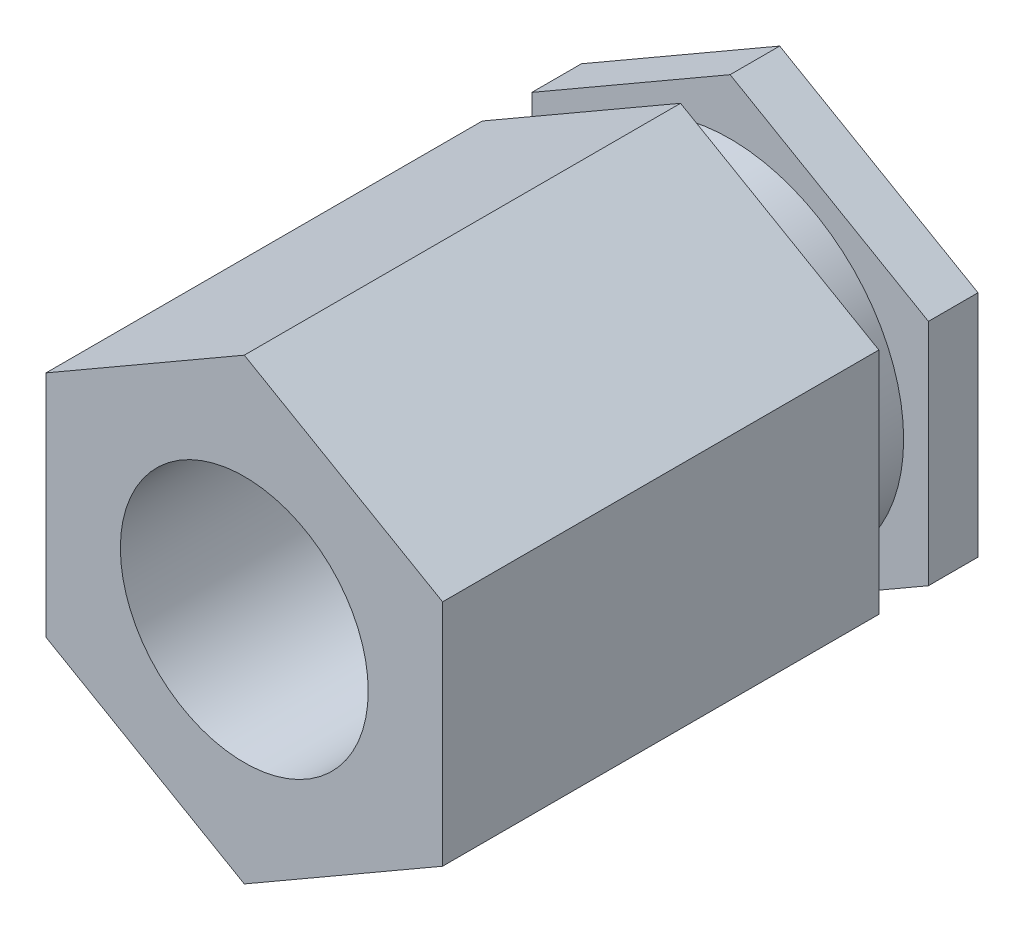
ISO-10303-21;
HEADER;
FILE_DESCRIPTION(('STEP AP214'),'2;1');
FILE_NAME('part.step','',(''),(''),'','','');
FILE_SCHEMA(('AUTOMOTIVE_DESIGN { 1 0 10303 214 1 1 1 1 }'));
ENDSEC;
DATA;
#1=APPLICATION_CONTEXT('core data for automotive mechanical design processes');
#2=APPLICATION_PROTOCOL_DEFINITION('international standard','automotive_design',2000,#1);
#3=PRODUCT_CONTEXT('',#1,'mechanical');
#4=PRODUCT('Part','Part','',(#3));
#5=PRODUCT_RELATED_PRODUCT_CATEGORY('part','',(#4));
#6=PRODUCT_DEFINITION_FORMATION('','',#4);
#7=PRODUCT_DEFINITION_CONTEXT('part definition',#1,'design');
#8=PRODUCT_DEFINITION('design','',#6,#7);
#9=PRODUCT_DEFINITION_SHAPE('','',#8);
#10=(LENGTH_UNIT() NAMED_UNIT(*) SI_UNIT(.MILLI.,.METRE.));
#11=(NAMED_UNIT(*) PLANE_ANGLE_UNIT() SI_UNIT($,.RADIAN.));
#12=(NAMED_UNIT(*) SI_UNIT($,.STERADIAN.) SOLID_ANGLE_UNIT());
#13=UNCERTAINTY_MEASURE_WITH_UNIT(LENGTH_MEASURE(1.E-05),#10,'distance_accuracy_value','');
#14=(GEOMETRIC_REPRESENTATION_CONTEXT(3) GLOBAL_UNCERTAINTY_ASSIGNED_CONTEXT((#13)) GLOBAL_UNIT_ASSIGNED_CONTEXT((#10,
#11,#12)) REPRESENTATION_CONTEXT('',''));
#15=CARTESIAN_POINT('',(0.,0.,0.));
#16=DIRECTION('',(0.,0.,1.));
#17=DIRECTION('',(1.,0.,0.));
#18=AXIS2_PLACEMENT_3D('',#15,#16,#17);
#19=CARTESIAN_POINT('',(4.,2.30940107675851,-10.8));
#20=DIRECTION('',(0.5,0.866025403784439,0.));
#21=DIRECTION('',(-0.866025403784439,0.5,0.));
#22=AXIS2_PLACEMENT_3D('',#19,#20,#21);
#23=PLANE('',#22);
#24=DIRECTION('',(0.,0.,1.));
#25=VECTOR('',#24,1.);
#26=CARTESIAN_POINT('',(4.,2.30940107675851,-10.8));
#27=LINE('',#26,#25);
#28=CARTESIAN_POINT('',(4.,2.30940107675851,-8.8));
#29=VERTEX_POINT('',#28);
#30=CARTESIAN_POINT('',(4.,2.30940107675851,0.));
#31=VERTEX_POINT('',#30);
#32=EDGE_CURVE('E485',#29,#31,#27,.T.);
#33=ORIENTED_EDGE('',*,*,#32,.F.);
#34=DIRECTION('',(-0.866025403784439,0.5,0.));
#35=VECTOR('',#34,1.);
#36=CARTESIAN_POINT('',(4.,2.30940107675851,-8.8));
#37=LINE('',#36,#35);
#38=CARTESIAN_POINT('',(0.,4.61880215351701,-8.8));
#39=VERTEX_POINT('',#38);
#40=EDGE_CURVE('E555',#29,#39,#37,.T.);
#41=ORIENTED_EDGE('',*,*,#40,.T.);
#42=DIRECTION('',(0.,0.,1.));
#43=VECTOR('',#42,1.);
#44=CARTESIAN_POINT('',(0.,4.61880215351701,-10.8));
#45=LINE('',#44,#43);
#46=CARTESIAN_POINT('',(0.,4.61880215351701,0.));
#47=VERTEX_POINT('',#46);
#48=EDGE_CURVE('E464',#39,#47,#45,.T.);
#49=ORIENTED_EDGE('',*,*,#48,.T.);
#50=DIRECTION('',(-0.866025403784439,0.5,0.));
#51=VECTOR('',#50,1.);
#52=CARTESIAN_POINT('',(4.,2.30940107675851,0.));
#53=LINE('',#52,#51);
#54=EDGE_CURVE('E563',#31,#47,#53,.T.);
#55=ORIENTED_EDGE('',*,*,#54,.F.);
#56=EDGE_LOOP('',(#33,#41,#49,#55));
#57=FACE_BOUND('',#56,.T.);
#58=ADVANCED_FACE('F350',(#57),#23,.T.);
#59=CARTESIAN_POINT('',(0.,4.61880215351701,-10.8));
#60=VERTEX_POINT('',#59);
#61=CARTESIAN_POINT('',(0.,4.61880215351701,-9.8));
#62=VERTEX_POINT('',#61);
#63=EDGE_CURVE('E461',#60,#62,#45,.T.);
#64=ORIENTED_EDGE('',*,*,#63,.T.);
#65=DIRECTION('',(0.866025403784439,-0.5,0.));
#66=VECTOR('',#65,1.);
#67=CARTESIAN_POINT('',(4.,2.30940107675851,-9.8));
#68=LINE('',#67,#66);
#69=CARTESIAN_POINT('',(4.,2.30940107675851,-9.8));
#70=VERTEX_POINT('',#69);
#71=EDGE_CURVE('E371',#62,#70,#68,.T.);
#72=ORIENTED_EDGE('',*,*,#71,.T.);
#73=CARTESIAN_POINT('',(4.,2.30940107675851,-10.8));
#74=VERTEX_POINT('',#73);
#75=EDGE_CURVE('E442',#74,#70,#27,.T.);
#76=ORIENTED_EDGE('',*,*,#75,.F.);
#77=DIRECTION('',(-0.866025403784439,0.5,0.));
#78=VECTOR('',#77,1.);
#79=CARTESIAN_POINT('',(4.,2.30940107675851,-10.8));
#80=LINE('',#79,#78);
#81=EDGE_CURVE('E527',#74,#60,#80,.T.);
#82=ORIENTED_EDGE('',*,*,#81,.T.);
#83=EDGE_LOOP('',(#64,#72,#76,#82));
#84=FACE_BOUND('',#83,.T.);
#85=ADVANCED_FACE('F577',(#84),#23,.T.);
#86=CARTESIAN_POINT('',(4.,-2.3094010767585,-10.8));
#87=DIRECTION('',(1.,0.,0.));
#88=DIRECTION('',(0.,0.,-1.));
#89=AXIS2_PLACEMENT_3D('',#86,#87,#88);
#90=PLANE('',#89);
#91=DIRECTION('',(0.,0.,1.));
#92=VECTOR('',#91,1.);
#93=CARTESIAN_POINT('',(4.,-2.3094010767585,-10.8));
#94=LINE('',#93,#92);
#95=CARTESIAN_POINT('',(4.,-2.3094010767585,-8.8));
#96=VERTEX_POINT('',#95);
#97=CARTESIAN_POINT('',(4.,-2.3094010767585,0.));
#98=VERTEX_POINT('',#97);
#99=EDGE_CURVE('E488',#96,#98,#94,.T.);
#100=ORIENTED_EDGE('',*,*,#99,.F.);
#101=DIRECTION('',(0.,1.,0.));
#102=VECTOR('',#101,1.);
#103=CARTESIAN_POINT('',(4.,-2.3094010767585,-8.8));
#104=LINE('',#103,#102);
#105=EDGE_CURVE('E552',#96,#29,#104,.T.);
#106=ORIENTED_EDGE('',*,*,#105,.T.);
#107=ORIENTED_EDGE('',*,*,#32,.T.);
#108=DIRECTION('',(0.,1.,0.));
#109=VECTOR('',#108,1.);
#110=CARTESIAN_POINT('',(4.,-2.3094010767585,0.));
#111=LINE('',#110,#109);
#112=EDGE_CURVE('E514',#98,#31,#111,.T.);
#113=ORIENTED_EDGE('',*,*,#112,.F.);
#114=EDGE_LOOP('',(#100,#106,#107,#113));
#115=FACE_BOUND('',#114,.T.);
#116=ADVANCED_FACE('F581',(#115),#90,.T.);
#117=ORIENTED_EDGE('',*,*,#75,.T.);
#118=DIRECTION('',(0.,-1.,0.));
#119=VECTOR('',#118,1.);
#120=CARTESIAN_POINT('',(4.,-2.3094010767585,-9.8));
#121=LINE('',#120,#119);
#122=CARTESIAN_POINT('',(4.,-2.3094010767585,-9.8));
#123=VERTEX_POINT('',#122);
#124=EDGE_CURVE('E542',#70,#123,#121,.T.);
#125=ORIENTED_EDGE('',*,*,#124,.T.);
#126=CARTESIAN_POINT('',(4.,-2.3094010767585,-10.8));
#127=VERTEX_POINT('',#126);
#128=EDGE_CURVE('E486',#127,#123,#94,.T.);
#129=ORIENTED_EDGE('',*,*,#128,.F.);
#130=DIRECTION('',(0.,1.,0.));
#131=VECTOR('',#130,1.);
#132=CARTESIAN_POINT('',(4.,-2.3094010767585,-10.8));
#133=LINE('',#132,#131);
#134=EDGE_CURVE('E467',#127,#74,#133,.T.);
#135=ORIENTED_EDGE('',*,*,#134,.T.);
#136=EDGE_LOOP('',(#117,#125,#129,#135));
#137=FACE_BOUND('',#136,.T.);
#138=ADVANCED_FACE('F617',(#137),#90,.T.);
#139=CARTESIAN_POINT('',(0.,-4.61880215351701,-10.8));
#140=DIRECTION('',(0.5,-0.866025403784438,0.));
#141=DIRECTION('',(0.866025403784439,0.5,0.));
#142=AXIS2_PLACEMENT_3D('',#139,#140,#141);
#143=PLANE('',#142);
#144=DIRECTION('',(0.,0.,1.));
#145=VECTOR('',#144,1.);
#146=CARTESIAN_POINT('',(0.,-4.61880215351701,-10.8));
#147=LINE('',#146,#145);
#148=CARTESIAN_POINT('',(0.,-4.61880215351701,-8.8));
#149=VERTEX_POINT('',#148);
#150=CARTESIAN_POINT('',(0.,-4.61880215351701,0.));
#151=VERTEX_POINT('',#150);
#152=EDGE_CURVE('E491',#149,#151,#147,.T.);
#153=ORIENTED_EDGE('',*,*,#152,.F.);
#154=DIRECTION('',(0.866025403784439,0.5,0.));
#155=VECTOR('',#154,1.);
#156=CARTESIAN_POINT('',(0.,-4.61880215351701,-8.8));
#157=LINE('',#156,#155);
#158=EDGE_CURVE('E550',#149,#96,#157,.T.);
#159=ORIENTED_EDGE('',*,*,#158,.T.);
#160=ORIENTED_EDGE('',*,*,#99,.T.);
#161=DIRECTION('',(0.866025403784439,0.5,0.));
#162=VECTOR('',#161,1.);
#163=CARTESIAN_POINT('',(0.,-4.61880215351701,0.));
#164=LINE('',#163,#162);
#165=EDGE_CURVE('E508',#151,#98,#164,.T.);
#166=ORIENTED_EDGE('',*,*,#165,.F.);
#167=EDGE_LOOP('',(#153,#159,#160,#166));
#168=FACE_BOUND('',#167,.T.);
#169=ADVANCED_FACE('F509',(#168),#143,.T.);
#170=ORIENTED_EDGE('',*,*,#128,.T.);
#171=DIRECTION('',(-0.866025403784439,-0.5,0.));
#172=VECTOR('',#171,1.);
#173=CARTESIAN_POINT('',(0.,-4.61880215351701,-9.8));
#174=LINE('',#173,#172);
#175=CARTESIAN_POINT('',(0.,-4.61880215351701,-9.8));
#176=VERTEX_POINT('',#175);
#177=EDGE_CURVE('E540',#123,#176,#174,.T.);
#178=ORIENTED_EDGE('',*,*,#177,.T.);
#179=CARTESIAN_POINT('',(0.,-4.61880215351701,-10.8));
#180=VERTEX_POINT('',#179);
#181=EDGE_CURVE('E489',#180,#176,#147,.T.);
#182=ORIENTED_EDGE('',*,*,#181,.F.);
#183=DIRECTION('',(0.866025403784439,0.5,0.));
#184=VECTOR('',#183,1.);
#185=CARTESIAN_POINT('',(0.,-4.61880215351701,-10.8));
#186=LINE('',#185,#184);
#187=EDGE_CURVE('E474',#180,#127,#186,.T.);
#188=ORIENTED_EDGE('',*,*,#187,.T.);
#189=EDGE_LOOP('',(#170,#178,#182,#188));
#190=FACE_BOUND('',#189,.T.);
#191=ADVANCED_FACE('F538',(#190),#143,.T.);
#192=CARTESIAN_POINT('',(-4.,-2.30940107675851,-10.8));
#193=DIRECTION('',(-0.5,-0.866025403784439,0.));
#194=DIRECTION('',(0.866025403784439,-0.5,0.));
#195=AXIS2_PLACEMENT_3D('',#192,#193,#194);
#196=PLANE('',#195);
#197=DIRECTION('',(0.,0.,1.));
#198=VECTOR('',#197,1.);
#199=CARTESIAN_POINT('',(-4.,-2.30940107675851,-10.8));
#200=LINE('',#199,#198);
#201=CARTESIAN_POINT('',(-4.,-2.30940107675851,-8.8));
#202=VERTEX_POINT('',#201);
#203=CARTESIAN_POINT('',(-4.,-2.30940107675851,0.));
#204=VERTEX_POINT('',#203);
#205=EDGE_CURVE('E457',#202,#204,#200,.T.);
#206=ORIENTED_EDGE('',*,*,#205,.F.);
#207=DIRECTION('',(0.866025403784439,-0.5,0.));
#208=VECTOR('',#207,1.);
#209=CARTESIAN_POINT('',(-4.,-2.30940107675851,-8.8));
#210=LINE('',#209,#208);
#211=EDGE_CURVE('E504',#202,#149,#210,.T.);
#212=ORIENTED_EDGE('',*,*,#211,.T.);
#213=ORIENTED_EDGE('',*,*,#152,.T.);
#214=DIRECTION('',(0.866025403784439,-0.5,0.));
#215=VECTOR('',#214,1.);
#216=CARTESIAN_POINT('',(-4.,-2.30940107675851,0.));
#217=LINE('',#216,#215);
#218=EDGE_CURVE('E502',#204,#151,#217,.T.);
#219=ORIENTED_EDGE('',*,*,#218,.F.);
#220=EDGE_LOOP('',(#206,#212,#213,#219));
#221=FACE_BOUND('',#220,.T.);
#222=ADVANCED_FACE('F500',(#221),#196,.T.);
#223=ORIENTED_EDGE('',*,*,#181,.T.);
#224=DIRECTION('',(-0.866025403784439,0.5,0.));
#225=VECTOR('',#224,1.);
#226=CARTESIAN_POINT('',(-4.,-2.30940107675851,-9.8));
#227=LINE('',#226,#225);
#228=CARTESIAN_POINT('',(-4.,-2.30940107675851,-9.8));
#229=VERTEX_POINT('',#228);
#230=EDGE_CURVE('E450',#176,#229,#227,.T.);
#231=ORIENTED_EDGE('',*,*,#230,.T.);
#232=CARTESIAN_POINT('',(-4.,-2.30940107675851,-10.8));
#233=VERTEX_POINT('',#232);
#234=EDGE_CURVE('E449',#233,#229,#200,.T.);
#235=ORIENTED_EDGE('',*,*,#234,.F.);
#236=DIRECTION('',(0.866025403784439,-0.5,0.));
#237=VECTOR('',#236,1.);
#238=CARTESIAN_POINT('',(-4.,-2.30940107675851,-10.8));
#239=LINE('',#238,#237);
#240=EDGE_CURVE('E480',#233,#180,#239,.T.);
#241=ORIENTED_EDGE('',*,*,#240,.T.);
#242=EDGE_LOOP('',(#223,#231,#235,#241));
#243=FACE_BOUND('',#242,.T.);
#244=ADVANCED_FACE('F532',(#243),#196,.T.);
#245=CARTESIAN_POINT('',(-4.,2.3094010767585,-10.8));
#246=DIRECTION('',(-1.,0.,0.));
#247=DIRECTION('',(0.,-1.,0.));
#248=AXIS2_PLACEMENT_3D('',#245,#246,#247);
#249=PLANE('',#248);
#250=DIRECTION('',(0.,0.,1.));
#251=VECTOR('',#250,1.);
#252=CARTESIAN_POINT('',(-4.,2.3094010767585,-10.8));
#253=LINE('',#252,#251);
#254=CARTESIAN_POINT('',(-4.,2.3094010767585,-8.8));
#255=VERTEX_POINT('',#254);
#256=CARTESIAN_POINT('',(-4.,2.3094010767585,0.));
#257=VERTEX_POINT('',#256);
#258=EDGE_CURVE('E458',#255,#257,#253,.T.);
#259=ORIENTED_EDGE('',*,*,#258,.F.);
#260=DIRECTION('',(0.,-1.,0.));
#261=VECTOR('',#260,1.);
#262=CARTESIAN_POINT('',(-4.,2.3094010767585,-8.8));
#263=LINE('',#262,#261);
#264=EDGE_CURVE('E364',#255,#202,#263,.T.);
#265=ORIENTED_EDGE('',*,*,#264,.T.);
#266=ORIENTED_EDGE('',*,*,#205,.T.);
#267=DIRECTION('',(0.,-1.,0.));
#268=VECTOR('',#267,1.);
#269=CARTESIAN_POINT('',(-4.,2.3094010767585,0.));
#270=LINE('',#269,#268);
#271=EDGE_CURVE('E520',#257,#204,#270,.T.);
#272=ORIENTED_EDGE('',*,*,#271,.F.);
#273=EDGE_LOOP('',(#259,#265,#266,#272));
#274=FACE_BOUND('',#273,.T.);
#275=ADVANCED_FACE('F568',(#274),#249,.T.);
#276=ORIENTED_EDGE('',*,*,#234,.T.);
#277=DIRECTION('',(0.,1.,0.));
#278=VECTOR('',#277,1.);
#279=CARTESIAN_POINT('',(-4.,2.3094010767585,-9.8));
#280=LINE('',#279,#278);
#281=CARTESIAN_POINT('',(-4.,2.3094010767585,-9.8));
#282=VERTEX_POINT('',#281);
#283=EDGE_CURVE('E437',#229,#282,#280,.T.);
#284=ORIENTED_EDGE('',*,*,#283,.T.);
#285=CARTESIAN_POINT('',(-4.,2.3094010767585,-10.8));
#286=VERTEX_POINT('',#285);
#287=EDGE_CURVE('E447',#286,#282,#253,.T.);
#288=ORIENTED_EDGE('',*,*,#287,.F.);
#289=DIRECTION('',(0.,-1.,0.));
#290=VECTOR('',#289,1.);
#291=CARTESIAN_POINT('',(-4.,2.3094010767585,-10.8));
#292=LINE('',#291,#290);
#293=EDGE_CURVE('E530',#286,#233,#292,.T.);
#294=ORIENTED_EDGE('',*,*,#293,.T.);
#295=EDGE_LOOP('',(#276,#284,#288,#294));
#296=FACE_BOUND('',#295,.T.);
#297=ADVANCED_FACE('F445',(#296),#249,.T.);
#298=CARTESIAN_POINT('',(0.,4.61880215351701,-10.8));
#299=DIRECTION('',(-0.5,0.866025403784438,0.));
#300=DIRECTION('',(-0.866025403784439,-0.5,0.));
#301=AXIS2_PLACEMENT_3D('',#298,#299,#300);
#302=PLANE('',#301);
#303=ORIENTED_EDGE('',*,*,#48,.F.);
#304=DIRECTION('',(-0.866025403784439,-0.5,0.));
#305=VECTOR('',#304,1.);
#306=CARTESIAN_POINT('',(0.,4.61880215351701,-8.8));
#307=LINE('',#306,#305);
#308=EDGE_CURVE('E11',#39,#255,#307,.T.);
#309=ORIENTED_EDGE('',*,*,#308,.T.);
#310=ORIENTED_EDGE('',*,*,#258,.T.);
#311=DIRECTION('',(-0.866025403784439,-0.5,0.));
#312=VECTOR('',#311,1.);
#313=CARTESIAN_POINT('',(0.,4.61880215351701,0.));
#314=LINE('',#313,#312);
#315=EDGE_CURVE('E522',#47,#257,#314,.T.);
#316=ORIENTED_EDGE('',*,*,#315,.F.);
#317=EDGE_LOOP('',(#303,#309,#310,#316));
#318=FACE_BOUND('',#317,.T.);
#319=ADVANCED_FACE('F565',(#318),#302,.T.);
#320=ORIENTED_EDGE('',*,*,#287,.T.);
#321=DIRECTION('',(0.866025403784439,0.5,0.));
#322=VECTOR('',#321,1.);
#323=CARTESIAN_POINT('',(0.,4.61880215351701,-9.8));
#324=LINE('',#323,#322);
#325=EDGE_CURVE('E357',#282,#62,#324,.T.);
#326=ORIENTED_EDGE('',*,*,#325,.T.);
#327=ORIENTED_EDGE('',*,*,#63,.F.);
#328=DIRECTION('',(-0.866025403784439,-0.5,0.));
#329=VECTOR('',#328,1.);
#330=CARTESIAN_POINT('',(0.,4.61880215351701,-10.8));
#331=LINE('',#330,#329);
#332=EDGE_CURVE('E456',#60,#286,#331,.T.);
#333=ORIENTED_EDGE('',*,*,#332,.T.);
#334=EDGE_LOOP('',(#320,#326,#327,#333));
#335=FACE_BOUND('',#334,.T.);
#336=ADVANCED_FACE('F454',(#335),#302,.T.);
#337=CARTESIAN_POINT('',(4.,2.30940107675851,-10.8));
#338=DIRECTION('',(0.,0.,-1.));
#339=DIRECTION('',(-1.,0.,0.));
#340=AXIS2_PLACEMENT_3D('',#337,#338,#339);
#341=PLANE('',#340);
#342=CARTESIAN_POINT('',(0.,0.,-10.8));
#343=DIRECTION('',(0.,0.,1.));
#344=DIRECTION('',(1.,0.,0.));
#345=AXIS2_PLACEMENT_3D('',#342,#343,#344);
#346=CIRCLE('',#345,2.5);
#347=CARTESIAN_POINT('',(2.5,0.,-10.8));
#348=VERTEX_POINT('',#347);
#349=EDGE_CURVE('E560',#348,#348,#346,.T.);
#350=ORIENTED_EDGE('',*,*,#349,.T.);
#351=EDGE_LOOP('',(#350));
#352=FACE_BOUND('',#351,.T.);
#353=ORIENTED_EDGE('',*,*,#81,.F.);
#354=ORIENTED_EDGE('',*,*,#134,.F.);
#355=ORIENTED_EDGE('',*,*,#187,.F.);
#356=ORIENTED_EDGE('',*,*,#240,.F.);
#357=ORIENTED_EDGE('',*,*,#293,.F.);
#358=ORIENTED_EDGE('',*,*,#332,.F.);
#359=EDGE_LOOP('',(#353,#354,#355,#356,#357,#358));
#360=FACE_BOUND('',#359,.T.);
#361=ADVANCED_FACE('F536',(#352,#360),#341,.T.);
#362=CARTESIAN_POINT('',(4.,2.30940107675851,0.));
#363=DIRECTION('',(0.,0.,-1.));
#364=DIRECTION('',(-1.,0.,0.));
#365=AXIS2_PLACEMENT_3D('',#362,#363,#364);
#366=PLANE('',#365);
#367=CARTESIAN_POINT('',(0.,0.,0.));
#368=DIRECTION('',(0.,0.,1.));
#369=DIRECTION('',(1.,0.,0.));
#370=AXIS2_PLACEMENT_3D('',#367,#368,#369);
#371=CIRCLE('',#370,2.5);
#372=CARTESIAN_POINT('',(2.5,0.,0.));
#373=VERTEX_POINT('',#372);
#374=EDGE_CURVE('E557',#373,#373,#371,.T.);
#375=ORIENTED_EDGE('',*,*,#374,.F.);
#376=EDGE_LOOP('',(#375));
#377=FACE_BOUND('',#376,.T.);
#378=ORIENTED_EDGE('',*,*,#54,.T.);
#379=ORIENTED_EDGE('',*,*,#315,.T.);
#380=ORIENTED_EDGE('',*,*,#271,.T.);
#381=ORIENTED_EDGE('',*,*,#218,.T.);
#382=ORIENTED_EDGE('',*,*,#165,.T.);
#383=ORIENTED_EDGE('',*,*,#112,.T.);
#384=EDGE_LOOP('',(#378,#379,#380,#381,#382,#383));
#385=FACE_BOUND('',#384,.T.);
#386=ADVANCED_FACE('F517',(#377,#385),#366,.F.);
#387=CARTESIAN_POINT('',(0.,0.,-10.8));
#388=DIRECTION('',(0.,0.,1.));
#389=DIRECTION('',(1.,0.,0.));
#390=AXIS2_PLACEMENT_3D('',#387,#388,#389);
#391=CYLINDRICAL_SURFACE('',#390,2.5);
#392=CARTESIAN_POINT('',(2.5,0.,-10.8));
#393=CARTESIAN_POINT('',(2.5,0.,-10.6875));
#394=CARTESIAN_POINT('',(2.5,0.,-10.575));
#395=CARTESIAN_POINT('',(2.5,0.,-10.35));
#396=CARTESIAN_POINT('',(2.5,0.,-10.2375));
#397=CARTESIAN_POINT('',(2.5,0.,-10.0125));
#398=CARTESIAN_POINT('',(2.5,0.,-9.9));
#399=CARTESIAN_POINT('',(2.5,0.,-9.675));
#400=CARTESIAN_POINT('',(2.5,0.,-9.5625));
#401=CARTESIAN_POINT('',(2.5,0.,-9.3375));
#402=CARTESIAN_POINT('',(2.5,0.,-9.225));
#403=CARTESIAN_POINT('',(2.5,0.,-9.));
#404=CARTESIAN_POINT('',(2.5,0.,-8.8875));
#405=CARTESIAN_POINT('',(2.5,0.,-8.6625));
#406=CARTESIAN_POINT('',(2.5,0.,-8.55));
#407=CARTESIAN_POINT('',(2.5,0.,-8.325));
#408=CARTESIAN_POINT('',(2.5,0.,-8.2125));
#409=CARTESIAN_POINT('',(2.5,0.,-7.9875));
#410=CARTESIAN_POINT('',(2.5,0.,-7.875));
#411=CARTESIAN_POINT('',(2.5,0.,-7.65));
#412=CARTESIAN_POINT('',(2.5,0.,-7.5375));
#413=CARTESIAN_POINT('',(2.5,0.,-7.3125));
#414=CARTESIAN_POINT('',(2.5,0.,-7.2));
#415=CARTESIAN_POINT('',(2.5,0.,-6.975));
#416=CARTESIAN_POINT('',(2.5,0.,-6.8625));
#417=CARTESIAN_POINT('',(2.5,0.,-6.6375));
#418=CARTESIAN_POINT('',(2.5,0.,-6.525));
#419=CARTESIAN_POINT('',(2.5,0.,-6.3));
#420=CARTESIAN_POINT('',(2.5,0.,-6.1875));
#421=CARTESIAN_POINT('',(2.5,0.,-5.9625));
#422=CARTESIAN_POINT('',(2.5,0.,-5.85));
#423=CARTESIAN_POINT('',(2.5,0.,-5.625));
#424=CARTESIAN_POINT('',(2.5,0.,-5.5125));
#425=CARTESIAN_POINT('',(2.5,0.,-5.2875));
#426=CARTESIAN_POINT('',(2.5,0.,-5.175));
#427=CARTESIAN_POINT('',(2.5,0.,-4.95));
#428=CARTESIAN_POINT('',(2.5,0.,-4.8375));
#429=CARTESIAN_POINT('',(2.5,0.,-4.6125));
#430=CARTESIAN_POINT('',(2.5,0.,-4.5));
#431=CARTESIAN_POINT('',(2.5,0.,-4.275));
#432=CARTESIAN_POINT('',(2.5,0.,-4.1625));
#433=CARTESIAN_POINT('',(2.5,0.,-3.9375));
#434=CARTESIAN_POINT('',(2.5,0.,-3.825));
#435=CARTESIAN_POINT('',(2.5,0.,-3.6));
#436=CARTESIAN_POINT('',(2.5,0.,-3.4875));
#437=CARTESIAN_POINT('',(2.5,0.,-3.2625));
#438=CARTESIAN_POINT('',(2.5,0.,-3.15));
#439=CARTESIAN_POINT('',(2.5,0.,-2.925));
#440=CARTESIAN_POINT('',(2.5,0.,-2.8125));
#441=CARTESIAN_POINT('',(2.5,0.,-2.5875));
#442=CARTESIAN_POINT('',(2.5,0.,-2.475));
#443=CARTESIAN_POINT('',(2.5,0.,-2.25));
#444=CARTESIAN_POINT('',(2.5,0.,-2.1375));
#445=CARTESIAN_POINT('',(2.5,0.,-1.9125));
#446=CARTESIAN_POINT('',(2.5,0.,-1.8));
#447=CARTESIAN_POINT('',(2.5,0.,-1.575));
#448=CARTESIAN_POINT('',(2.5,0.,-1.4625));
#449=CARTESIAN_POINT('',(2.5,0.,-1.2375));
#450=CARTESIAN_POINT('',(2.5,0.,-1.125));
#451=CARTESIAN_POINT('',(2.5,0.,-0.900000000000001));
#452=CARTESIAN_POINT('',(2.5,0.,-0.787500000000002));
#453=CARTESIAN_POINT('',(2.5,0.,-0.562500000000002));
#454=CARTESIAN_POINT('',(2.5,0.,-0.450000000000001));
#455=CARTESIAN_POINT('',(2.5,0.,-0.225000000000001));
#456=CARTESIAN_POINT('',(2.5,0.,-0.112500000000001));
#457=CARTESIAN_POINT('',(2.5,0.,0.));
#458=B_SPLINE_CURVE_WITH_KNOTS('',3,(#392,#393,#394,#395,#396,#397,#398,#399,#400,#401,#402,
#403,#404,#405,#406,#407,#408,#409,#410,#411,#412,#413,#414,#415,#416,#417,#418,#419,#420,#421,
#422,#423,#424,#425,#426,#427,#428,#429,#430,#431,#432,#433,#434,#435,#436,#437,#438,#439,#440,
#441,#442,#443,#444,#445,#446,#447,#448,#449,#450,#451,#452,#453,#454,#455,#456,#457),
.UNSPECIFIED.,.F.,.F.,(4,2,2,2,2,2,2,2,2,2,2,2,2,2,2,2,2,2,2,2,2,2,2,2,2,2,2,2,2,2,2,2,4),(0.,
0.337500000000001,0.675,1.0125,1.35,1.6875,2.025,2.3625,2.7,3.0375,3.375,3.7125,4.05,4.3875,
4.725,5.0625,5.4,5.7375,6.075,6.4125,6.75,7.0875,7.425,7.7625,8.1,8.4375,8.775,9.1125,9.45,
9.7875,10.125,10.4625,10.8),.UNSPECIFIED.);
#459=EDGE_CURVE('BSEAM588',#348,#373,#458,.T.);
#460=ORIENTED_EDGE('',*,*,#349,.F.);
#461=ORIENTED_EDGE('',*,*,#374,.T.);
#462=ORIENTED_EDGE('',*,*,#459,.T.);
#463=ORIENTED_EDGE('',*,*,#459,.F.);
#464=EDGE_LOOP('',(#460,#462,#461,#463));
#465=FACE_BOUND('',#464,.T.);
#466=ADVANCED_FACE('F588',(#465),#391,.F.);
#467=CARTESIAN_POINT('',(0.,5.3809541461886,-8.8));
#468=DIRECTION('',(0.,0.,-1.));
#469=DIRECTION('',(-1.,0.,0.));
#470=AXIS2_PLACEMENT_3D('',#467,#468,#469);
#471=PLANE('',#470);
#472=ORIENTED_EDGE('',*,*,#105,.F.);
#473=ORIENTED_EDGE('',*,*,#158,.F.);
#474=ORIENTED_EDGE('',*,*,#211,.F.);
#475=ORIENTED_EDGE('',*,*,#264,.F.);
#476=ORIENTED_EDGE('',*,*,#308,.F.);
#477=ORIENTED_EDGE('',*,*,#40,.F.);
#478=EDGE_LOOP('',(#472,#473,#474,#475,#476,#477));
#479=FACE_BOUND('',#478,.T.);
#480=CARTESIAN_POINT('',(0.,0.,-8.8));
#481=DIRECTION('',(0.,0.,1.));
#482=DIRECTION('',(1.,0.,0.));
#483=AXIS2_PLACEMENT_3D('',#480,#481,#482);
#484=CIRCLE('',#483,3.5);
#485=CARTESIAN_POINT('',(3.5,0.,-8.8));
#486=VERTEX_POINT('',#485);
#487=EDGE_CURVE('E451',#486,#486,#484,.T.);
#488=ORIENTED_EDGE('',*,*,#487,.T.);
#489=EDGE_LOOP('',(#488));
#490=FACE_BOUND('',#489,.T.);
#491=ADVANCED_FACE('F584',(#479,#490),#471,.T.);
#492=CARTESIAN_POINT('',(0.,0.,0.507779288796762));
#493=DIRECTION('',(0.,0.,1.));
#494=DIRECTION('',(1.,0.,0.));
#495=AXIS2_PLACEMENT_3D('',#492,#493,#494);
#496=CYLINDRICAL_SURFACE('',#495,3.5);
#497=CARTESIAN_POINT('',(0.,0.,-9.8));
#498=DIRECTION('',(0.,0.,1.));
#499=DIRECTION('',(1.,0.,0.));
#500=AXIS2_PLACEMENT_3D('',#497,#498,#499);
#501=CIRCLE('',#500,3.5);
#502=CARTESIAN_POINT('',(3.5,0.,-9.8));
#503=VERTEX_POINT('',#502);
#504=EDGE_CURVE('E593',#503,#503,#501,.T.);
#505=ORIENTED_EDGE('',*,*,#504,.T.);
#506=EDGE_LOOP('',(#505));
#507=FACE_BOUND('',#506,.T.);
#508=ORIENTED_EDGE('',*,*,#487,.F.);
#509=EDGE_LOOP('',(#508));
#510=FACE_BOUND('',#509,.T.);
#511=ADVANCED_FACE('F587',(#507,#510),#496,.T.);
#512=CARTESIAN_POINT('',(0.,5.3809541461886,-9.8));
#513=DIRECTION('',(0.,0.,1.));
#514=DIRECTION('',(1.,0.,0.));
#515=AXIS2_PLACEMENT_3D('',#512,#513,#514);
#516=PLANE('',#515);
#517=ORIENTED_EDGE('',*,*,#325,.F.);
#518=ORIENTED_EDGE('',*,*,#283,.F.);
#519=ORIENTED_EDGE('',*,*,#230,.F.);
#520=ORIENTED_EDGE('',*,*,#177,.F.);
#521=ORIENTED_EDGE('',*,*,#124,.F.);
#522=ORIENTED_EDGE('',*,*,#71,.F.);
#523=EDGE_LOOP('',(#517,#518,#519,#520,#521,#522));
#524=FACE_BOUND('',#523,.T.);
#525=ORIENTED_EDGE('',*,*,#504,.F.);
#526=EDGE_LOOP('',(#525));
#527=FACE_BOUND('',#526,.T.);
#528=ADVANCED_FACE('F435',(#524,#527),#516,.T.);
#529=CLOSED_SHELL('',(#58,#85,#116,#138,#169,#191,#222,#244,#275,#297,#319,#336,#361,#386,#466,
#491,#511,#528));
#530=MANIFOLD_SOLID_BREP('B2',#529);
#531=ADVANCED_BREP_SHAPE_REPRESENTATION('',(#18,#530),#14);
#532=SHAPE_DEFINITION_REPRESENTATION(#9,#531);
ENDSEC;
END-ISO-10303-21;
